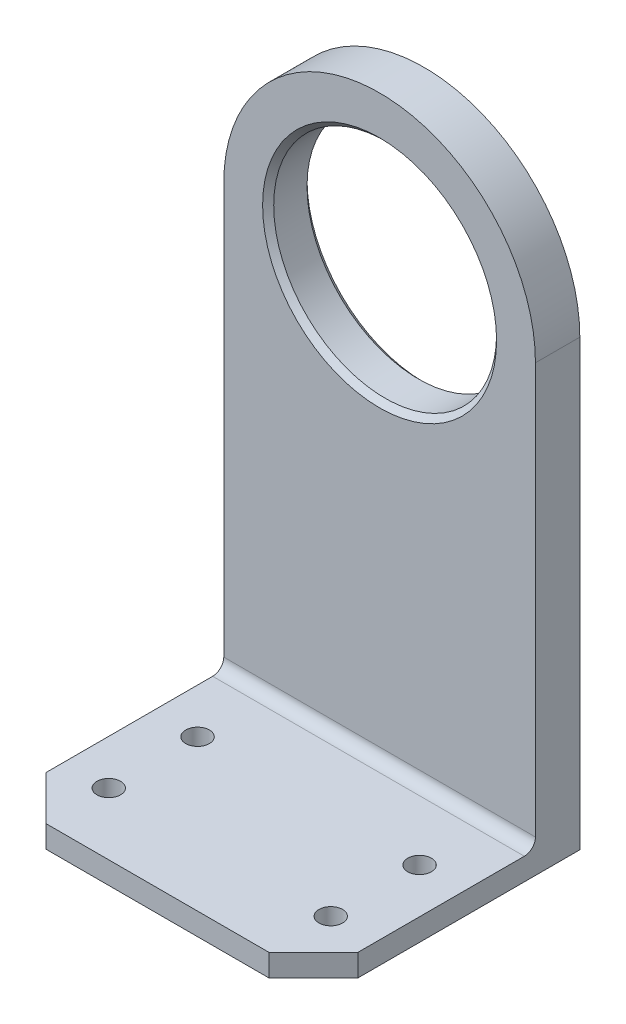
ISO-10303-21;
HEADER;
FILE_DESCRIPTION(('STEP AP214'),'2;1');
FILE_NAME('part.step','',(''),(''),'','','');
FILE_SCHEMA(('AUTOMOTIVE_DESIGN { 1 0 10303 214 1 1 1 1 }'));
ENDSEC;
DATA;
#1=APPLICATION_CONTEXT('core data for automotive mechanical design processes');
#2=APPLICATION_PROTOCOL_DEFINITION('international standard','automotive_design',2000,#1);
#3=PRODUCT_CONTEXT('',#1,'mechanical');
#4=PRODUCT('Part','Part','',(#3));
#5=PRODUCT_RELATED_PRODUCT_CATEGORY('part','',(#4));
#6=PRODUCT_DEFINITION_FORMATION('','',#4);
#7=PRODUCT_DEFINITION_CONTEXT('part definition',#1,'design');
#8=PRODUCT_DEFINITION('design','',#6,#7);
#9=PRODUCT_DEFINITION_SHAPE('','',#8);
#10=(LENGTH_UNIT() NAMED_UNIT(*) SI_UNIT(.MILLI.,.METRE.));
#11=(NAMED_UNIT(*) PLANE_ANGLE_UNIT() SI_UNIT($,.RADIAN.));
#12=(NAMED_UNIT(*) SI_UNIT($,.STERADIAN.) SOLID_ANGLE_UNIT());
#13=UNCERTAINTY_MEASURE_WITH_UNIT(LENGTH_MEASURE(1.E-05),#10,'distance_accuracy_value','');
#14=(GEOMETRIC_REPRESENTATION_CONTEXT(3) GLOBAL_UNCERTAINTY_ASSIGNED_CONTEXT((#13)) GLOBAL_UNIT_ASSIGNED_CONTEXT((#10,
#11,#12)) REPRESENTATION_CONTEXT('',''));
#15=CARTESIAN_POINT('',(0.,0.,0.));
#16=DIRECTION('',(0.,0.,1.));
#17=DIRECTION('',(1.,0.,0.));
#18=AXIS2_PLACEMENT_3D('',#15,#16,#17);
#19=CARTESIAN_POINT('',(0.,0.,12.7));
#20=DIRECTION('',(0.,0.,1.));
#21=DIRECTION('',(1.,0.,0.));
#22=AXIS2_PLACEMENT_3D('',#19,#20,#21);
#23=PLANE('',#22);
#24=CARTESIAN_POINT('',(0.,0.,12.7));
#25=DIRECTION('',(0.,0.,1.));
#26=DIRECTION('',(1.,0.,0.));
#27=AXIS2_PLACEMENT_3D('',#24,#25,#26);
#28=CIRCLE('',#27,33.4625);
#29=CARTESIAN_POINT('',(33.4625,0.,12.7));
#30=VERTEX_POINT('',#29);
#31=EDGE_CURVE('E39',#30,#30,#28,.F.);
#32=ORIENTED_EDGE('',*,*,#31,.T.);
#33=EDGE_LOOP('',(#32));
#34=FACE_BOUND('',#33,.T.);
#35=DIRECTION('',(0.,-1.,0.));
#36=VECTOR('',#35,1.);
#37=CARTESIAN_POINT('',(-44.575,0.,12.7));
#38=LINE('',#37,#36);
#39=CARTESIAN_POINT('',(-44.575,0.,12.7));
#40=VERTEX_POINT('',#39);
#41=CARTESIAN_POINT('',(-44.575,-117.475,12.7));
#42=VERTEX_POINT('',#41);
#43=EDGE_CURVE('E103',#40,#42,#38,.T.);
#44=ORIENTED_EDGE('',*,*,#43,.T.);
#45=DIRECTION('',(-1.,0.,0.));
#46=VECTOR('',#45,1.);
#47=CARTESIAN_POINT('',(0.,-117.475,12.7));
#48=LINE('',#47,#46);
#49=CARTESIAN_POINT('',(44.575,-117.475,12.7));
#50=VERTEX_POINT('',#49);
#51=EDGE_CURVE('E131',#42,#50,#48,.F.);
#52=ORIENTED_EDGE('',*,*,#51,.T.);
#53=DIRECTION('',(0.,1.,0.));
#54=VECTOR('',#53,1.);
#55=CARTESIAN_POINT('',(44.575,0.,12.7));
#56=LINE('',#55,#54);
#57=CARTESIAN_POINT('',(44.575,0.,12.7));
#58=VERTEX_POINT('',#57);
#59=EDGE_CURVE('E114',#50,#58,#56,.T.);
#60=ORIENTED_EDGE('',*,*,#59,.T.);
#61=CARTESIAN_POINT('',(0.,0.,12.7));
#62=DIRECTION('',(0.,0.,1.));
#63=DIRECTION('',(1.,0.,0.));
#64=AXIS2_PLACEMENT_3D('',#61,#62,#63);
#65=CIRCLE('',#64,44.575);
#66=EDGE_CURVE('E115',#58,#40,#65,.T.);
#67=ORIENTED_EDGE('',*,*,#66,.T.);
#68=EDGE_LOOP('',(#44,#52,#60,#67));
#69=FACE_BOUND('',#68,.T.);
#70=ADVANCED_FACE('F31',(#34,#69),#23,.T.);
#71=CARTESIAN_POINT('',(0.,0.,0.));
#72=DIRECTION('',(0.,0.,1.));
#73=DIRECTION('',(1.,0.,0.));
#74=AXIS2_PLACEMENT_3D('',#71,#72,#73);
#75=PLANE('',#74);
#76=CARTESIAN_POINT('',(0.,0.,0.));
#77=DIRECTION('',(0.,0.,1.));
#78=DIRECTION('',(1.,0.,0.));
#79=AXIS2_PLACEMENT_3D('',#76,#77,#78);
#80=CIRCLE('',#79,33.4625);
#81=CARTESIAN_POINT('',(33.4625,0.,0.));
#82=VERTEX_POINT('',#81);
#83=EDGE_CURVE('E11',#82,#82,#80,.T.);
#84=ORIENTED_EDGE('',*,*,#83,.T.);
#85=EDGE_LOOP('',(#84));
#86=FACE_BOUND('',#85,.T.);
#87=CARTESIAN_POINT('',(0.,0.,0.));
#88=DIRECTION('',(0.,0.,1.));
#89=DIRECTION('',(1.,0.,0.));
#90=AXIS2_PLACEMENT_3D('',#87,#88,#89);
#91=CIRCLE('',#90,44.575);
#92=CARTESIAN_POINT('',(44.575,0.,0.));
#93=VERTEX_POINT('',#92);
#94=CARTESIAN_POINT('',(-44.575,0.,0.));
#95=VERTEX_POINT('',#94);
#96=EDGE_CURVE('E126',#93,#95,#91,.T.);
#97=ORIENTED_EDGE('',*,*,#96,.F.);
#98=DIRECTION('',(0.,1.,0.));
#99=VECTOR('',#98,1.);
#100=CARTESIAN_POINT('',(44.575,0.,0.));
#101=LINE('',#100,#99);
#102=CARTESIAN_POINT('',(44.575,-127.,0.));
#103=VERTEX_POINT('',#102);
#104=EDGE_CURVE('E122',#103,#93,#101,.T.);
#105=ORIENTED_EDGE('',*,*,#104,.F.);
#106=DIRECTION('',(1.,0.,0.));
#107=VECTOR('',#106,1.);
#108=CARTESIAN_POINT('',(44.575,-127.,0.));
#109=LINE('',#108,#107);
#110=CARTESIAN_POINT('',(-44.575,-127.,0.));
#111=VERTEX_POINT('',#110);
#112=EDGE_CURVE('E210',#111,#103,#109,.T.);
#113=ORIENTED_EDGE('',*,*,#112,.F.);
#114=DIRECTION('',(0.,-1.,0.));
#115=VECTOR('',#114,1.);
#116=CARTESIAN_POINT('',(-44.575,0.,0.));
#117=LINE('',#116,#115);
#118=EDGE_CURVE('E209',#95,#111,#117,.T.);
#119=ORIENTED_EDGE('',*,*,#118,.F.);
#120=EDGE_LOOP('',(#97,#105,#113,#119));
#121=FACE_BOUND('',#120,.T.);
#122=ADVANCED_FACE('F203',(#86,#121),#75,.F.);
#123=CARTESIAN_POINT('',(0.,0.,12.7));
#124=DIRECTION('',(0.,0.,-1.));
#125=DIRECTION('',(-1.,0.,0.));
#126=AXIS2_PLACEMENT_3D('',#123,#124,#125);
#127=CYLINDRICAL_SURFACE('',#126,44.575);
#128=ORIENTED_EDGE('',*,*,#96,.T.);
#129=DIRECTION('',(0.,0.,-1.));
#130=VECTOR('',#129,1.);
#131=CARTESIAN_POINT('',(-44.575,0.,12.7));
#132=LINE('',#131,#130);
#133=EDGE_CURVE('E108',#40,#95,#132,.T.);
#134=ORIENTED_EDGE('',*,*,#133,.F.);
#135=ORIENTED_EDGE('',*,*,#66,.F.);
#136=DIRECTION('',(0.,0.,-1.));
#137=VECTOR('',#136,1.);
#138=CARTESIAN_POINT('',(44.575,0.,12.7));
#139=LINE('',#138,#137);
#140=EDGE_CURVE('E148',#58,#93,#139,.T.);
#141=ORIENTED_EDGE('',*,*,#140,.T.);
#142=EDGE_LOOP('',(#128,#134,#135,#141));
#143=FACE_BOUND('',#142,.T.);
#144=ADVANCED_FACE('F124',(#143),#127,.T.);
#145=CARTESIAN_POINT('',(-44.575,0.,12.7));
#146=DIRECTION('',(1.,0.,0.));
#147=DIRECTION('',(0.,1.,0.));
#148=AXIS2_PLACEMENT_3D('',#145,#146,#147);
#149=PLANE('',#148);
#150=DIRECTION('',(0.,0.,-1.));
#151=VECTOR('',#150,1.);
#152=CARTESIAN_POINT('',(-44.575,-127.,12.7));
#153=LINE('',#152,#151);
#154=CARTESIAN_POINT('',(-44.575,-127.,63.4999999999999));
#155=VERTEX_POINT('',#154);
#156=EDGE_CURVE('E128',#155,#111,#153,.T.);
#157=ORIENTED_EDGE('',*,*,#156,.F.);
#158=DIRECTION('',(0.,1.,0.));
#159=VECTOR('',#158,1.);
#160=CARTESIAN_POINT('',(-44.575,-120.65,63.4999999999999));
#161=LINE('',#160,#159);
#162=CARTESIAN_POINT('',(-44.575,-120.65,63.4999999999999));
#163=VERTEX_POINT('',#162);
#164=EDGE_CURVE('E174',#155,#163,#161,.T.);
#165=ORIENTED_EDGE('',*,*,#164,.T.);
#166=DIRECTION('',(0.,0.,-1.));
#167=VECTOR('',#166,1.);
#168=CARTESIAN_POINT('',(-44.575,-120.65,76.2));
#169=LINE('',#168,#167);
#170=CARTESIAN_POINT('',(-44.575,-120.65,15.875));
#171=VERTEX_POINT('',#170);
#172=EDGE_CURVE('E163',#163,#171,#169,.T.);
#173=ORIENTED_EDGE('',*,*,#172,.T.);
#174=CARTESIAN_POINT('',(-44.575,-117.475,15.875));
#175=DIRECTION('',(1.,0.,0.));
#176=DIRECTION('',(0.,1.,0.));
#177=AXIS2_PLACEMENT_3D('',#174,#175,#176);
#178=CIRCLE('',#177,3.175);
#179=EDGE_CURVE('E111',#171,#42,#178,.T.);
#180=ORIENTED_EDGE('',*,*,#179,.T.);
#181=ORIENTED_EDGE('',*,*,#43,.F.);
#182=ORIENTED_EDGE('',*,*,#133,.T.);
#183=ORIENTED_EDGE('',*,*,#118,.T.);
#184=EDGE_LOOP('',(#157,#165,#173,#180,#181,#182,#183));
#185=FACE_BOUND('',#184,.T.);
#186=ADVANCED_FACE('F105',(#185),#149,.F.);
#187=CARTESIAN_POINT('',(44.575,-127.,12.7));
#188=DIRECTION('',(0.,1.,0.));
#189=DIRECTION('',(0.,0.,1.));
#190=AXIS2_PLACEMENT_3D('',#187,#188,#189);
#191=PLANE('',#190);
#192=CARTESIAN_POINT('',(31.75,-127.,58.42));
#193=DIRECTION('',(0.,1.,0.));
#194=DIRECTION('',(1.,0.,0.));
#195=AXIS2_PLACEMENT_3D('',#192,#193,#194);
#196=CIRCLE('',#195,3.3782);
#197=CARTESIAN_POINT('',(35.1282,-127.,58.42));
#198=VERTEX_POINT('',#197);
#199=EDGE_CURVE('E248',#198,#198,#196,.T.);
#200=ORIENTED_EDGE('',*,*,#199,.T.);
#201=EDGE_LOOP('',(#200));
#202=FACE_BOUND('',#201,.T.);
#203=CARTESIAN_POINT('',(31.75,-127.,33.02));
#204=DIRECTION('',(0.,1.,0.));
#205=DIRECTION('',(1.,0.,0.));
#206=AXIS2_PLACEMENT_3D('',#203,#204,#205);
#207=CIRCLE('',#206,3.38582);
#208=CARTESIAN_POINT('',(35.13582,-127.,33.02));
#209=VERTEX_POINT('',#208);
#210=EDGE_CURVE('E242',#209,#209,#207,.T.);
#211=ORIENTED_EDGE('',*,*,#210,.T.);
#212=EDGE_LOOP('',(#211));
#213=FACE_BOUND('',#212,.T.);
#214=CARTESIAN_POINT('',(-31.75,-127.,58.42));
#215=DIRECTION('',(0.,1.,0.));
#216=DIRECTION('',(-1.,0.,0.));
#217=AXIS2_PLACEMENT_3D('',#214,#215,#216);
#218=CIRCLE('',#217,3.3782);
#219=CARTESIAN_POINT('',(-35.1282,-127.,58.42));
#220=VERTEX_POINT('',#219);
#221=EDGE_CURVE('E236',#220,#220,#218,.T.);
#222=ORIENTED_EDGE('',*,*,#221,.T.);
#223=EDGE_LOOP('',(#222));
#224=FACE_BOUND('',#223,.T.);
#225=CARTESIAN_POINT('',(-31.75,-127.,33.02));
#226=DIRECTION('',(0.,1.,0.));
#227=DIRECTION('',(-1.,0.,0.));
#228=AXIS2_PLACEMENT_3D('',#225,#226,#227);
#229=CIRCLE('',#228,3.38582);
#230=CARTESIAN_POINT('',(-35.13582,-127.,33.02));
#231=VERTEX_POINT('',#230);
#232=EDGE_CURVE('E230',#231,#231,#229,.T.);
#233=ORIENTED_EDGE('',*,*,#232,.T.);
#234=EDGE_LOOP('',(#233));
#235=FACE_BOUND('',#234,.T.);
#236=DIRECTION('',(0.,0.,-1.));
#237=VECTOR('',#236,1.);
#238=CARTESIAN_POINT('',(44.575,-127.,12.7));
#239=LINE('',#238,#237);
#240=CARTESIAN_POINT('',(44.575,-127.,63.4999999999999));
#241=VERTEX_POINT('',#240);
#242=EDGE_CURVE('E133',#241,#103,#239,.T.);
#243=ORIENTED_EDGE('',*,*,#242,.F.);
#244=DIRECTION('',(-0.707106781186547,0.,0.707106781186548));
#245=VECTOR('',#244,1.);
#246=CARTESIAN_POINT('',(31.875,-127.,76.2));
#247=LINE('',#246,#245);
#248=CARTESIAN_POINT('',(31.875,-127.,76.2));
#249=VERTEX_POINT('',#248);
#250=EDGE_CURVE('E172',#241,#249,#247,.T.);
#251=ORIENTED_EDGE('',*,*,#250,.T.);
#252=DIRECTION('',(1.,0.,0.));
#253=VECTOR('',#252,1.);
#254=CARTESIAN_POINT('',(-44.575,-127.,76.2));
#255=LINE('',#254,#253);
#256=CARTESIAN_POINT('',(-31.875,-127.,76.2));
#257=VERTEX_POINT('',#256);
#258=EDGE_CURVE('E229',#257,#249,#255,.T.);
#259=ORIENTED_EDGE('',*,*,#258,.F.);
#260=DIRECTION('',(-0.707106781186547,0.,-0.707106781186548));
#261=VECTOR('',#260,1.);
#262=CARTESIAN_POINT('',(-31.875,-127.,76.2));
#263=LINE('',#262,#261);
#264=EDGE_CURVE('E46',#257,#155,#263,.T.);
#265=ORIENTED_EDGE('',*,*,#264,.T.);
#266=ORIENTED_EDGE('',*,*,#156,.T.);
#267=ORIENTED_EDGE('',*,*,#112,.T.);
#268=EDGE_LOOP('',(#243,#251,#259,#265,#266,#267));
#269=FACE_BOUND('',#268,.T.);
#270=ADVANCED_FACE('F216',(#202,#213,#224,#235,#269),#191,.F.);
#271=CARTESIAN_POINT('',(44.575,0.,12.7));
#272=DIRECTION('',(-1.,0.,0.));
#273=DIRECTION('',(0.,-1.,0.));
#274=AXIS2_PLACEMENT_3D('',#271,#272,#273);
#275=PLANE('',#274);
#276=DIRECTION('',(0.,0.,-1.));
#277=VECTOR('',#276,1.);
#278=CARTESIAN_POINT('',(44.575,-120.65,76.2));
#279=LINE('',#278,#277);
#280=CARTESIAN_POINT('',(44.575,-120.65,63.4999999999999));
#281=VERTEX_POINT('',#280);
#282=CARTESIAN_POINT('',(44.575,-120.65,15.875));
#283=VERTEX_POINT('',#282);
#284=EDGE_CURVE('E161',#281,#283,#279,.T.);
#285=ORIENTED_EDGE('',*,*,#284,.F.);
#286=DIRECTION('',(0.,-1.,0.));
#287=VECTOR('',#286,1.);
#288=CARTESIAN_POINT('',(44.575,-127.,63.4999999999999));
#289=LINE('',#288,#287);
#290=EDGE_CURVE('E54',#281,#241,#289,.T.);
#291=ORIENTED_EDGE('',*,*,#290,.T.);
#292=ORIENTED_EDGE('',*,*,#242,.T.);
#293=ORIENTED_EDGE('',*,*,#104,.T.);
#294=ORIENTED_EDGE('',*,*,#140,.F.);
#295=ORIENTED_EDGE('',*,*,#59,.F.);
#296=CARTESIAN_POINT('',(44.575,-117.475,15.875));
#297=DIRECTION('',(-1.,0.,0.));
#298=DIRECTION('',(0.,-1.,0.));
#299=AXIS2_PLACEMENT_3D('',#296,#297,#298);
#300=CIRCLE('',#299,3.175);
#301=EDGE_CURVE('E151',#50,#283,#300,.T.);
#302=ORIENTED_EDGE('',*,*,#301,.T.);
#303=EDGE_LOOP('',(#285,#291,#292,#293,#294,#295,#302));
#304=FACE_BOUND('',#303,.T.);
#305=ADVANCED_FACE('F195',(#304),#275,.F.);
#306=CARTESIAN_POINT('',(0.,0.,12.7));
#307=DIRECTION('',(0.,0.,-1.));
#308=DIRECTION('',(-1.,0.,0.));
#309=AXIS2_PLACEMENT_3D('',#306,#307,#308);
#310=CYLINDRICAL_SURFACE('',#309,31.875);
#311=CARTESIAN_POINT('',(0.,0.,11.1125));
#312=DIRECTION('',(0.,0.,1.));
#313=DIRECTION('',(1.,0.,0.));
#314=AXIS2_PLACEMENT_3D('',#311,#312,#313);
#315=CIRCLE('',#314,31.875);
#316=CARTESIAN_POINT('',(31.875,0.,11.1125));
#317=VERTEX_POINT('',#316);
#318=EDGE_CURVE('E179',#317,#317,#315,.T.);
#319=ORIENTED_EDGE('',*,*,#318,.T.);
#320=EDGE_LOOP('',(#319));
#321=FACE_BOUND('',#320,.T.);
#322=CARTESIAN_POINT('',(0.,0.,1.58749999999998));
#323=DIRECTION('',(0.,0.,1.));
#324=DIRECTION('',(1.,0.,0.));
#325=AXIS2_PLACEMENT_3D('',#322,#323,#324);
#326=CIRCLE('',#325,31.875);
#327=CARTESIAN_POINT('',(31.875,0.,1.58749999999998));
#328=VERTEX_POINT('',#327);
#329=EDGE_CURVE('E176',#328,#328,#326,.F.);
#330=ORIENTED_EDGE('',*,*,#329,.T.);
#331=EDGE_LOOP('',(#330));
#332=FACE_BOUND('',#331,.T.);
#333=ADVANCED_FACE('F191',(#321,#332),#310,.F.);
#334=CARTESIAN_POINT('',(-44.575,-120.65,76.2));
#335=DIRECTION('',(0.,-1.,0.));
#336=DIRECTION('',(0.,0.,-1.));
#337=AXIS2_PLACEMENT_3D('',#334,#335,#336);
#338=PLANE('',#337);
#339=CARTESIAN_POINT('',(31.75,-120.65,58.42));
#340=DIRECTION('',(0.,1.,0.));
#341=DIRECTION('',(1.,0.,0.));
#342=AXIS2_PLACEMENT_3D('',#339,#340,#341);
#343=CIRCLE('',#342,3.3782);
#344=CARTESIAN_POINT('',(35.1282,-120.65,58.42));
#345=VERTEX_POINT('',#344);
#346=EDGE_CURVE('E251',#345,#345,#343,.T.);
#347=ORIENTED_EDGE('',*,*,#346,.F.);
#348=EDGE_LOOP('',(#347));
#349=FACE_BOUND('',#348,.T.);
#350=CARTESIAN_POINT('',(31.75,-120.65,33.02));
#351=DIRECTION('',(0.,1.,0.));
#352=DIRECTION('',(1.,0.,0.));
#353=AXIS2_PLACEMENT_3D('',#350,#351,#352);
#354=CIRCLE('',#353,3.38582);
#355=CARTESIAN_POINT('',(35.13582,-120.65,33.02));
#356=VERTEX_POINT('',#355);
#357=EDGE_CURVE('E245',#356,#356,#354,.T.);
#358=ORIENTED_EDGE('',*,*,#357,.F.);
#359=EDGE_LOOP('',(#358));
#360=FACE_BOUND('',#359,.T.);
#361=CARTESIAN_POINT('',(-31.75,-120.65,58.42));
#362=DIRECTION('',(0.,1.,0.));
#363=DIRECTION('',(-1.,0.,0.));
#364=AXIS2_PLACEMENT_3D('',#361,#362,#363);
#365=CIRCLE('',#364,3.3782);
#366=CARTESIAN_POINT('',(-35.1282,-120.65,58.42));
#367=VERTEX_POINT('',#366);
#368=EDGE_CURVE('E239',#367,#367,#365,.T.);
#369=ORIENTED_EDGE('',*,*,#368,.F.);
#370=EDGE_LOOP('',(#369));
#371=FACE_BOUND('',#370,.T.);
#372=CARTESIAN_POINT('',(-31.75,-120.65,33.02));
#373=DIRECTION('',(0.,1.,0.));
#374=DIRECTION('',(-1.,0.,0.));
#375=AXIS2_PLACEMENT_3D('',#372,#373,#374);
#376=CIRCLE('',#375,3.38582);
#377=CARTESIAN_POINT('',(-35.13582,-120.65,33.02));
#378=VERTEX_POINT('',#377);
#379=EDGE_CURVE('E233',#378,#378,#376,.T.);
#380=ORIENTED_EDGE('',*,*,#379,.F.);
#381=EDGE_LOOP('',(#380));
#382=FACE_BOUND('',#381,.T.);
#383=DIRECTION('',(-1.,0.,0.));
#384=VECTOR('',#383,1.);
#385=CARTESIAN_POINT('',(-44.575,-120.65,76.2));
#386=LINE('',#385,#384);
#387=CARTESIAN_POINT('',(31.875,-120.65,76.2));
#388=VERTEX_POINT('',#387);
#389=CARTESIAN_POINT('',(-31.875,-120.65,76.2));
#390=VERTEX_POINT('',#389);
#391=EDGE_CURVE('E166',#388,#390,#386,.T.);
#392=ORIENTED_EDGE('',*,*,#391,.F.);
#393=DIRECTION('',(0.707106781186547,0.,-0.707106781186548));
#394=VECTOR('',#393,1.);
#395=CARTESIAN_POINT('',(31.875,-120.65,76.2));
#396=LINE('',#395,#394);
#397=EDGE_CURVE('E168',#388,#281,#396,.T.);
#398=ORIENTED_EDGE('',*,*,#397,.T.);
#399=ORIENTED_EDGE('',*,*,#284,.T.);
#400=DIRECTION('',(-1.,0.,0.));
#401=VECTOR('',#400,1.);
#402=CARTESIAN_POINT('',(-44.575,-120.65,15.875));
#403=LINE('',#402,#401);
#404=EDGE_CURVE('E127',#283,#171,#403,.T.);
#405=ORIENTED_EDGE('',*,*,#404,.T.);
#406=ORIENTED_EDGE('',*,*,#172,.F.);
#407=DIRECTION('',(0.707106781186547,0.,0.707106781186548));
#408=VECTOR('',#407,1.);
#409=CARTESIAN_POINT('',(-31.875,-120.65,76.2));
#410=LINE('',#409,#408);
#411=EDGE_CURVE('E160',#163,#390,#410,.T.);
#412=ORIENTED_EDGE('',*,*,#411,.T.);
#413=EDGE_LOOP('',(#392,#398,#399,#405,#406,#412));
#414=FACE_BOUND('',#413,.T.);
#415=ADVANCED_FACE('F194',(#349,#360,#371,#382,#414),#338,.F.);
#416=CARTESIAN_POINT('',(-44.575,-127.,76.2));
#417=DIRECTION('',(0.,0.,1.));
#418=DIRECTION('',(1.,0.,0.));
#419=AXIS2_PLACEMENT_3D('',#416,#417,#418);
#420=PLANE('',#419);
#421=ORIENTED_EDGE('',*,*,#258,.T.);
#422=DIRECTION('',(0.,1.,0.));
#423=VECTOR('',#422,1.);
#424=CARTESIAN_POINT('',(31.875,-120.65,76.2));
#425=LINE('',#424,#423);
#426=EDGE_CURVE('E157',#249,#388,#425,.T.);
#427=ORIENTED_EDGE('',*,*,#426,.T.);
#428=ORIENTED_EDGE('',*,*,#391,.T.);
#429=DIRECTION('',(0.,-1.,0.));
#430=VECTOR('',#429,1.);
#431=CARTESIAN_POINT('',(-31.875,-127.,76.2));
#432=LINE('',#431,#430);
#433=EDGE_CURVE('E154',#390,#257,#432,.T.);
#434=ORIENTED_EDGE('',*,*,#433,.T.);
#435=EDGE_LOOP('',(#421,#427,#428,#434));
#436=FACE_BOUND('',#435,.T.);
#437=ADVANCED_FACE('F227',(#436),#420,.T.);
#438=CARTESIAN_POINT('',(-31.75,-127.,33.02));
#439=DIRECTION('',(0.,1.,0.));
#440=DIRECTION('',(-1.,0.,0.));
#441=AXIS2_PLACEMENT_3D('',#438,#439,#440);
#442=CYLINDRICAL_SURFACE('',#441,3.38582);
#443=ORIENTED_EDGE('',*,*,#232,.F.);
#444=EDGE_LOOP('',(#443));
#445=FACE_BOUND('',#444,.T.);
#446=ORIENTED_EDGE('',*,*,#379,.T.);
#447=EDGE_LOOP('',(#446));
#448=FACE_BOUND('',#447,.T.);
#449=ADVANCED_FACE('F276',(#445,#448),#442,.F.);
#450=CARTESIAN_POINT('',(-31.75,-127.,58.42));
#451=DIRECTION('',(0.,1.,0.));
#452=DIRECTION('',(-1.,0.,0.));
#453=AXIS2_PLACEMENT_3D('',#450,#451,#452);
#454=CYLINDRICAL_SURFACE('',#453,3.3782);
#455=ORIENTED_EDGE('',*,*,#221,.F.);
#456=EDGE_LOOP('',(#455));
#457=FACE_BOUND('',#456,.T.);
#458=ORIENTED_EDGE('',*,*,#368,.T.);
#459=EDGE_LOOP('',(#458));
#460=FACE_BOUND('',#459,.T.);
#461=ADVANCED_FACE('F278',(#457,#460),#454,.F.);
#462=CARTESIAN_POINT('',(31.75,-127.,33.02));
#463=DIRECTION('',(0.,1.,0.));
#464=DIRECTION('',(-1.,0.,0.));
#465=AXIS2_PLACEMENT_3D('',#462,#463,#464);
#466=CYLINDRICAL_SURFACE('',#465,3.38582);
#467=ORIENTED_EDGE('',*,*,#210,.F.);
#468=EDGE_LOOP('',(#467));
#469=FACE_BOUND('',#468,.T.);
#470=ORIENTED_EDGE('',*,*,#357,.T.);
#471=EDGE_LOOP('',(#470));
#472=FACE_BOUND('',#471,.T.);
#473=ADVANCED_FACE('F263',(#469,#472),#466,.F.);
#474=CARTESIAN_POINT('',(31.75,-127.,58.42));
#475=DIRECTION('',(0.,1.,0.));
#476=DIRECTION('',(-1.,0.,0.));
#477=AXIS2_PLACEMENT_3D('',#474,#475,#476);
#478=CYLINDRICAL_SURFACE('',#477,3.3782);
#479=ORIENTED_EDGE('',*,*,#199,.F.);
#480=EDGE_LOOP('',(#479));
#481=FACE_BOUND('',#480,.T.);
#482=ORIENTED_EDGE('',*,*,#346,.T.);
#483=EDGE_LOOP('',(#482));
#484=FACE_BOUND('',#483,.T.);
#485=ADVANCED_FACE('F259',(#481,#484),#478,.F.);
#486=CARTESIAN_POINT('',(-44.575,-117.475,15.875));
#487=DIRECTION('',(-1.,0.,0.));
#488=DIRECTION('',(0.,0.,1.));
#489=AXIS2_PLACEMENT_3D('',#486,#487,#488);
#490=CYLINDRICAL_SURFACE('',#489,3.175);
#491=ORIENTED_EDGE('',*,*,#301,.F.);
#492=ORIENTED_EDGE('',*,*,#51,.F.);
#493=ORIENTED_EDGE('',*,*,#179,.F.);
#494=ORIENTED_EDGE('',*,*,#404,.F.);
#495=EDGE_LOOP('',(#491,#492,#493,#494));
#496=FACE_BOUND('',#495,.T.);
#497=ADVANCED_FACE('F262',(#496),#490,.F.);
#498=CARTESIAN_POINT('',(31.875,-127.,76.2));
#499=DIRECTION('',(0.707106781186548,0.,0.707106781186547));
#500=DIRECTION('',(0.707106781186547,0.,-0.707106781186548));
#501=AXIS2_PLACEMENT_3D('',#498,#499,#500);
#502=PLANE('',#501);
#503=ORIENTED_EDGE('',*,*,#250,.F.);
#504=ORIENTED_EDGE('',*,*,#290,.F.);
#505=ORIENTED_EDGE('',*,*,#397,.F.);
#506=ORIENTED_EDGE('',*,*,#426,.F.);
#507=EDGE_LOOP('',(#503,#504,#505,#506));
#508=FACE_BOUND('',#507,.T.);
#509=ADVANCED_FACE('F304',(#508),#502,.T.);
#510=CARTESIAN_POINT('',(-31.875,-127.,76.2));
#511=DIRECTION('',(-0.707106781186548,0.,0.707106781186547));
#512=DIRECTION('',(0.707106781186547,0.,0.707106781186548));
#513=AXIS2_PLACEMENT_3D('',#510,#511,#512);
#514=PLANE('',#513);
#515=ORIENTED_EDGE('',*,*,#411,.F.);
#516=ORIENTED_EDGE('',*,*,#164,.F.);
#517=ORIENTED_EDGE('',*,*,#264,.F.);
#518=ORIENTED_EDGE('',*,*,#433,.F.);
#519=EDGE_LOOP('',(#515,#516,#517,#518));
#520=FACE_BOUND('',#519,.T.);
#521=ADVANCED_FACE('F188',(#520),#514,.T.);
#522=CARTESIAN_POINT('',(0.,0.,11.1125));
#523=DIRECTION('',(0.,0.,1.));
#524=DIRECTION('',(1.,0.,0.));
#525=AXIS2_PLACEMENT_3D('',#522,#523,#524);
#526=CONICAL_SURFACE('',#525,31.875,0.785398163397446);
#527=ORIENTED_EDGE('',*,*,#31,.F.);
#528=EDGE_LOOP('',(#527));
#529=FACE_BOUND('',#528,.T.);
#530=ORIENTED_EDGE('',*,*,#318,.F.);
#531=EDGE_LOOP('',(#530));
#532=FACE_BOUND('',#531,.T.);
#533=ADVANCED_FACE('F185',(#529,#532),#526,.F.);
#534=CARTESIAN_POINT('',(0.,0.,0.));
#535=DIRECTION('',(0.,0.,-1.));
#536=DIRECTION('',(-1.,0.,0.));
#537=AXIS2_PLACEMENT_3D('',#534,#535,#536);
#538=CONICAL_SURFACE('',#537,33.4625,0.785398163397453);
#539=ORIENTED_EDGE('',*,*,#329,.F.);
#540=EDGE_LOOP('',(#539));
#541=FACE_BOUND('',#540,.T.);
#542=ORIENTED_EDGE('',*,*,#83,.F.);
#543=EDGE_LOOP('',(#542));
#544=FACE_BOUND('',#543,.T.);
#545=ADVANCED_FACE('F33',(#541,#544),#538,.F.);
#546=CLOSED_SHELL('',(#70,#122,#144,#186,#270,#305,#333,#415,#437,#449,#461,#473,#485,#497,#509,
#521,#533,#545));
#547=MANIFOLD_SOLID_BREP('B2',#546);
#548=ADVANCED_BREP_SHAPE_REPRESENTATION('',(#18,#547),#14);
#549=SHAPE_DEFINITION_REPRESENTATION(#9,#548);
ENDSEC;
END-ISO-10303-21;
